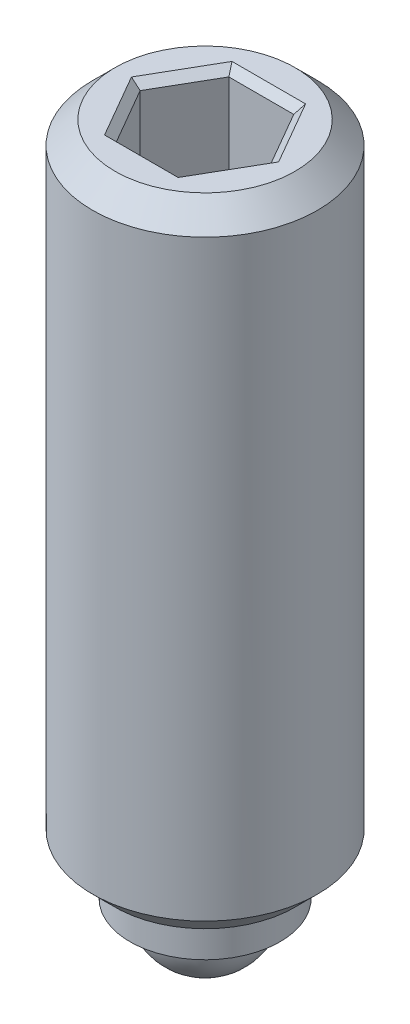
from build123d import *

# Parameters (mm, degrees)
CHANFREIN1_SIZE         = 0.3
CHANFREIN3_SIZE         = 0.3
ENL_V_MAT_EXTRU_1_DEPTH = 3
CHANFREIN2_SIZE         = 0.1


with BuildPart() as part:
    # Esquisse1 → R_volution1 (revolve)
    with BuildSketch(Plane.XY, mode=Mode.PRIVATE) as r_volution1_sk:
        Polygon((0, 0), (0, 9), (1.5, 9), (1.5, 0.5), (1, 0.5), (1, 0), align=None)
    revolve(r_volution1_sk.sketch.rotate(Axis((0, 0, 0), (0, 1, 0)), 90), axis=Axis((0, 0, 0), (0, 1, 0)))

    # Esquisse2 → R_volution2 (revolve)
    with BuildSketch(Plane.XY):
        with BuildLine():
            Line((0, -0.75), (0, 0.75))
            ThreePointArc((0, 0.75), (0.75, 0), (0, -0.75))
        make_face()
    revolve(axis=Axis((0, -0.75, 0), (0, 1, 0)))

    # Chanfrein1
    chanfrein1_edges = [part.edges().sort_by_distance(p)[0] for p in [
        (0, 9, 1.5),
    ]]
    chamfer(chanfrein1_edges, length=CHANFREIN1_SIZE)

    # Chanfrein3
    chanfrein3_edges = [part.edges().sort_by_distance(p)[0] for p in [
        (0, 0.5, 1.5),
    ]]
    chamfer(chanfrein3_edges, length=CHANFREIN3_SIZE)

    # Esquisse3 → Enl_v. mat.-Extru.1 (cut)
    with BuildSketch(Plane(origin=(0, 9, 0), x_dir=(1, 0, 0), z_dir=(0, 1, 0))):
        Polygon((0.866025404, 0), (0.433012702, 0.75), (-0.433012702, 0.75), (-0.866025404, 0), (-0.433012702, -0.75), (0.433012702, -0.75), align=None)
    extrude(amount=-ENL_V_MAT_EXTRU_1_DEPTH, mode=Mode.SUBTRACT)

    # Chanfrein2
    chanfrein2_edges = [part.edges().sort_by_distance(p)[0] for p in [
        (0.649519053, 9, 0.375),
        (0.649519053, 9, -0.375),
        (0, 9, -0.75),
        (-0.649519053, 9, -0.375),
        (-0.649519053, 9, 0.375),
        (0, 9, 0.75),
    ]]
    chamfer(chanfrein2_edges, length=CHANFREIN2_SIZE)


solid = part.part
